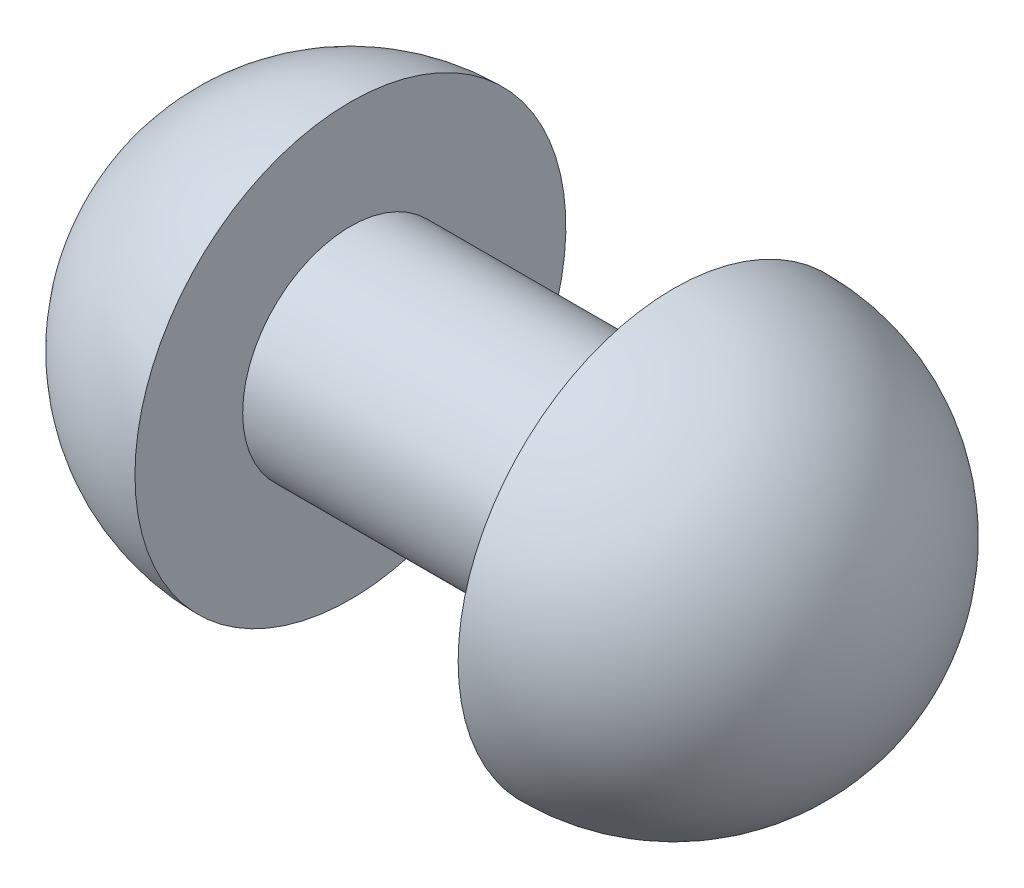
ISO-10303-21;
HEADER;
FILE_DESCRIPTION(('STEP AP214'),'2;1');
FILE_NAME('part.step','',(''),(''),'','','');
FILE_SCHEMA(('AUTOMOTIVE_DESIGN { 1 0 10303 214 1 1 1 1 }'));
ENDSEC;
DATA;
#1=APPLICATION_CONTEXT('core data for automotive mechanical design processes');
#2=APPLICATION_PROTOCOL_DEFINITION('international standard','automotive_design',2000,#1);
#3=PRODUCT_CONTEXT('',#1,'mechanical');
#4=PRODUCT('Part','Part','',(#3));
#5=PRODUCT_RELATED_PRODUCT_CATEGORY('part','',(#4));
#6=PRODUCT_DEFINITION_FORMATION('','',#4);
#7=PRODUCT_DEFINITION_CONTEXT('part definition',#1,'design');
#8=PRODUCT_DEFINITION('design','',#6,#7);
#9=PRODUCT_DEFINITION_SHAPE('','',#8);
#10=(LENGTH_UNIT() NAMED_UNIT(*) SI_UNIT(.MILLI.,.METRE.));
#11=(NAMED_UNIT(*) PLANE_ANGLE_UNIT() SI_UNIT($,.RADIAN.));
#12=(NAMED_UNIT(*) SI_UNIT($,.STERADIAN.) SOLID_ANGLE_UNIT());
#13=UNCERTAINTY_MEASURE_WITH_UNIT(LENGTH_MEASURE(1.E-05),#10,'distance_accuracy_value','');
#14=(GEOMETRIC_REPRESENTATION_CONTEXT(3) GLOBAL_UNCERTAINTY_ASSIGNED_CONTEXT((#13)) GLOBAL_UNIT_ASSIGNED_CONTEXT((#10,
#11,#12)) REPRESENTATION_CONTEXT('',''));
#15=CARTESIAN_POINT('',(0.,0.,0.));
#16=DIRECTION('',(0.,0.,1.));
#17=DIRECTION('',(1.,0.,0.));
#18=AXIS2_PLACEMENT_3D('',#15,#16,#17);
#19=CARTESIAN_POINT('',(-14.3,0.,0.));
#20=DIRECTION('',(-1.,0.,0.));
#21=DIRECTION('',(0.,0.,1.));
#22=AXIS2_PLACEMENT_3D('',#19,#20,#21);
#23=CYLINDRICAL_SURFACE('',#22,2.);
#24=CARTESIAN_POINT('',(-6.,0.,0.));
#25=DIRECTION('',(-1.,0.,0.));
#26=DIRECTION('',(0.,0.,1.));
#27=AXIS2_PLACEMENT_3D('',#24,#25,#26);
#28=CIRCLE('',#27,2.);
#29=CARTESIAN_POINT('',(-6.,0.,2.));
#30=VERTEX_POINT('',#29);
#31=EDGE_CURVE('E10',#30,#30,#28,.T.);
#32=ORIENTED_EDGE('',*,*,#31,.F.);
#33=EDGE_LOOP('',(#32));
#34=FACE_BOUND('',#33,.T.);
#35=CARTESIAN_POINT('',(0.,0.,0.));
#36=DIRECTION('',(-1.,0.,0.));
#37=DIRECTION('',(0.,0.,1.));
#38=AXIS2_PLACEMENT_3D('',#35,#36,#37);
#39=CIRCLE('',#38,2.);
#40=CARTESIAN_POINT('',(0.,0.,2.));
#41=VERTEX_POINT('',#40);
#42=EDGE_CURVE('E362',#41,#41,#39,.T.);
#43=ORIENTED_EDGE('',*,*,#42,.T.);
#44=EDGE_LOOP('',(#43));
#45=FACE_BOUND('',#44,.T.);
#46=ADVANCED_FACE('F348',(#34,#45),#23,.T.);
#47=CARTESIAN_POINT('',(-6.,4.,0.));
#48=DIRECTION('',(-1.,0.,0.));
#49=DIRECTION('',(0.,0.,1.));
#50=AXIS2_PLACEMENT_3D('',#47,#48,#49);
#51=PLANE('',#50);
#52=CARTESIAN_POINT('',(-6.,0.,0.));
#53=DIRECTION('',(-1.,0.,0.));
#54=DIRECTION('',(0.,0.,1.));
#55=AXIS2_PLACEMENT_3D('',#52,#53,#54);
#56=CIRCLE('',#55,4.);
#57=CARTESIAN_POINT('',(-6.,0.,4.));
#58=VERTEX_POINT('',#57);
#59=EDGE_CURVE('E354',#58,#58,#56,.T.);
#60=ORIENTED_EDGE('',*,*,#59,.F.);
#61=EDGE_LOOP('',(#60));
#62=FACE_BOUND('',#61,.T.);
#63=ORIENTED_EDGE('',*,*,#31,.T.);
#64=EDGE_LOOP('',(#63));
#65=FACE_BOUND('',#64,.T.);
#66=ADVANCED_FACE('F382',(#62,#65),#51,.F.);
#67=CARTESIAN_POINT('',(-6.,0.,0.));
#68=DIRECTION('',(-1.,0.,0.));
#69=DIRECTION('',(0.,1.,0.));
#70=AXIS2_PLACEMENT_3D('',#67,#68,#69);
#71=SPHERICAL_SURFACE('',#70,4.);
#72=ORIENTED_EDGE('',*,*,#59,.T.);
#73=EDGE_LOOP('',(#72));
#74=FACE_BOUND('',#73,.T.);
#75=ADVANCED_FACE('F377',(#74),#71,.T.);
#76=CARTESIAN_POINT('',(0.,0.,0.));
#77=DIRECTION('',(-1.,0.,0.));
#78=DIRECTION('',(0.,1.,0.));
#79=AXIS2_PLACEMENT_3D('',#76,#77,#78);
#80=SPHERICAL_SURFACE('',#79,4.);
#81=CARTESIAN_POINT('',(0.,0.,0.));
#82=DIRECTION('',(-1.,0.,0.));
#83=DIRECTION('',(0.,0.,1.));
#84=AXIS2_PLACEMENT_3D('',#81,#82,#83);
#85=CIRCLE('',#84,4.);
#86=CARTESIAN_POINT('',(0.,0.,4.));
#87=VERTEX_POINT('',#86);
#88=EDGE_CURVE('E358',#87,#87,#85,.T.);
#89=ORIENTED_EDGE('',*,*,#88,.F.);
#90=EDGE_LOOP('',(#89));
#91=FACE_BOUND('',#90,.T.);
#92=ADVANCED_FACE('F372',(#91),#80,.T.);
#93=CARTESIAN_POINT('',(0.,4.,0.));
#94=DIRECTION('',(1.,0.,0.));
#95=DIRECTION('',(0.,0.,-1.));
#96=AXIS2_PLACEMENT_3D('',#93,#94,#95);
#97=PLANE('',#96);
#98=ORIENTED_EDGE('',*,*,#42,.F.);
#99=EDGE_LOOP('',(#98));
#100=FACE_BOUND('',#99,.T.);
#101=ORIENTED_EDGE('',*,*,#88,.T.);
#102=EDGE_LOOP('',(#101));
#103=FACE_BOUND('',#102,.T.);
#104=ADVANCED_FACE('F369',(#100,#103),#97,.F.);
#105=CLOSED_SHELL('',(#46,#66,#75,#92,#104));
#106=MANIFOLD_SOLID_BREP('B2',#105);
#107=ADVANCED_BREP_SHAPE_REPRESENTATION('',(#18,#106),#14);
#108=SHAPE_DEFINITION_REPRESENTATION(#9,#107);
ENDSEC;
END-ISO-10303-21;
